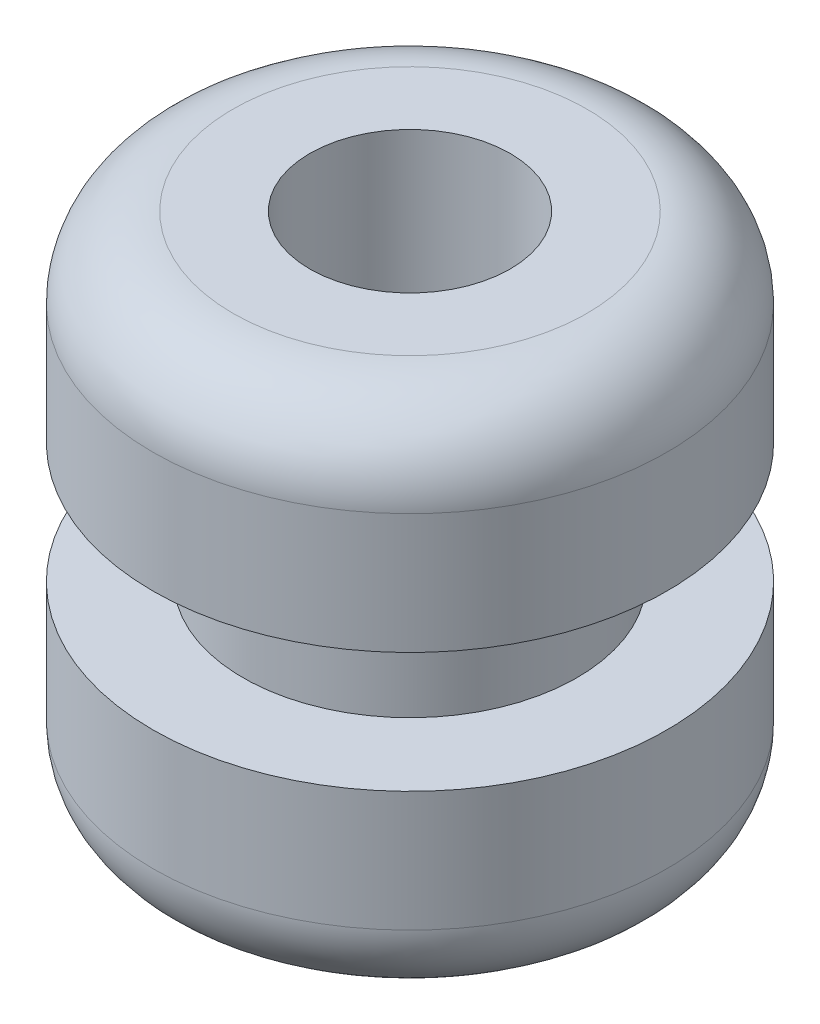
from build123d import *

# Parameters (mm, degrees)
FILLET1_R          = 1.524
SKETCH2_R          = 1.905
CUT_EXTRUDE1_DEPTH = 13.080697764


with BuildPart() as part:
    # Sketch1 → Revolve1 (revolve)
    with BuildSketch(Plane(origin=(0, 0, 0), x_dir=(0, 0, -1), z_dir=(1, 0, 0))):
        Polygon((3.175, 0), (4.8895, 0), (4.8895, -3.81), (0, -3.81), (0, 6.096), (4.8895, 6.096), (4.8895, 2.286), (3.175, 2.286), align=None)
    revolve(axis=Axis((0, 0, 0), (0, 1, 0)))

    # Fillet1
    fillet1_edges = [part.edges().sort_by_distance(p)[0] for p in [
        (0, 6.096, 4.8895),
        (0, -3.81, 4.8895),
    ]]
    fillet(fillet1_edges, radius=FILLET1_R)

    # Sketch2 → Cut-Extrude1 (cut, through all)
    with BuildSketch(Plane(origin=(0, 6.096, 0), x_dir=(1, 0, 0), z_dir=(0, 1, 0))):
        with Locations(Location((0, 0, 0), (0, 0, 270))):
            Circle(SKETCH2_R)
    extrude(amount=-CUT_EXTRUDE1_DEPTH, mode=Mode.SUBTRACT)


solid = part.part
